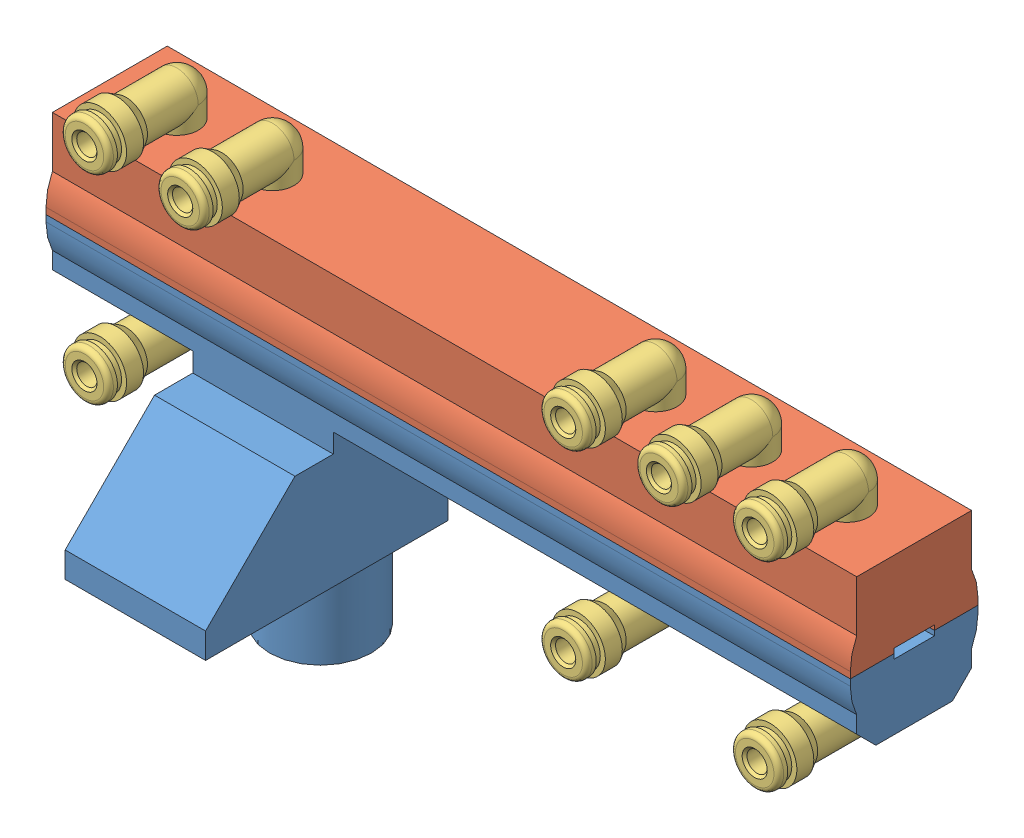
SolidWorks assembly GasTent.SLDASM, configuration Default (file format 7000). Lengths in mm.
Overall size (126 64.98 39).
10 component instances, 3 part files, 12 mates.
Components (placement in the parent):
- TentBottom-1: TentBottom.SLDPRT [Default] at (-30 28 0) size (126 44 39)
- TentTop-1: TentTop.SLDPRT [Default] at (90 30 0) x (-1 0 0) z (0 0 1) size (126 13.36 20)
- 5779K682_PUSH-TO-CONNECT TUBE FITTING FOR AIR-1: 5779K682_PUSH-TO-CONNECT TUBE FITTING FOR AIR.SLDPRT [5779K682] at (82.5 14.571 0) x (-1 0 0) z (0 0 -1) size (8.38 11.62 17.83)
- 5779K682_PUSH-TO-CONNECT TUBE FITTING FOR AIR-2: 5779K682_PUSH-TO-CONNECT TUBE FITTING FOR AIR.SLDPRT [5779K682] at (52.5 14.571 0) x (-1 0 0) z (0 0 -1) size (8.38 11.62 17.83)
- 5779K682_PUSH-TO-CONNECT TUBE FITTING FOR AIR-3: 5779K682_PUSH-TO-CONNECT TUBE FITTING FOR AIR.SLDPRT [5779K682] at (-22.5 14.571 0) x (-1 0 0) z (0 0 -1) size (8.38 11.62 17.83)
- 5779K682_PUSH-TO-CONNECT TUBE FITTING FOR AIR-4: 5779K682_PUSH-TO-CONNECT TUBE FITTING FOR AIR.SLDPRT [5779K682] at (-22.5 45.7879 0) x (1 0 0) z (0 0 -1) size (8.38 11.62 17.83)
- 5779K682_PUSH-TO-CONNECT TUBE FITTING FOR AIR-5: 5779K682_PUSH-TO-CONNECT TUBE FITTING FOR AIR.SLDPRT [5779K682] at (-7.5 45.7879 0) x (1 0 0) z (0 0 -1) size (8.38 11.62 17.83)
- 5779K682_PUSH-TO-CONNECT TUBE FITTING FOR AIR-6: 5779K682_PUSH-TO-CONNECT TUBE FITTING FOR AIR.SLDPRT [5779K682] at (52.5 45.7879 0) x (1 0 0) z (0 0 -1) size (8.38 11.62 17.83)
- 5779K682_PUSH-TO-CONNECT TUBE FITTING FOR AIR-7: 5779K682_PUSH-TO-CONNECT TUBE FITTING FOR AIR.SLDPRT [5779K682] at (67.5 45.7879 0) x (1 0 0) z (0 0 -1) size (8.38 11.62 17.83)
- 5779K682_PUSH-TO-CONNECT TUBE FITTING FOR AIR-8: 5779K682_PUSH-TO-CONNECT TUBE FITTING FOR AIR.SLDPRT [5779K682] at (82.5 45.7879 0) x (1 0 0) z (0 0 -1) size (8.38 11.62 17.83)
Mates (geometry in assembly coordinates):
- Concentric1: concentric: cylinder of TentBottom-1 through (0 -15 0) axis (0 1 0) radius 7.99; point of assembly
- Coincident2: coincident anti-aligned: plane of TentBottom-1 through (90 0 0) normal (0 -1 0); plane of assembly through (0 0 0) normal (0 1 0)
- Coincident4: coincident anti-aligned: plane of TentBottom-1 through (-30 29 0) normal (0 1 0); plane of TentTop-1 through (90 29 0) normal (0 -1 0)
- Coincident5: coincident aligned: plane of TentBottom-1 through (93 28 0) normal (1 0 0); plane of TentTop-1 through (93 30 0) normal (1 0 0)
- Concentric2: concentric anti-aligned: cylinder of TentBottom-1 through (-22.5 29 0) axis (0 -1 0) radius 1.7; cylinder of TentTop-1 through (-22.5 29 0) axis (0 1 0) radius 1.7
- Concentric3: concentric aligned: cylinder of TentBottom-1 through (82.5 29 0) axis (0 -1 0) radius 1.7; cylinder of 5779K682_PUSH-TO-CONNECT TUBE FITTING FOR AIR-1 through (82.5 38.2381 0) axis (0 -1 0) radius 1.5875
- Coincident6: coincident anti-aligned: plane of TentBottom-1 through (11 18 -10) normal (0 -1 0); plane of 5779K682_PUSH-TO-CONNECT TUBE FITTING FOR AIR-1 through (82.5 18 0) normal (0 1 0)
- Parallel2: parallel aligned: plane of TentBottom-1 through (90 28 9) normal (0 0 1); plane of 5779K682_PUSH-TO-CONNECT TUBE FITTING FOR AIR-1 through (82.5 17.5809 14.478) normal (0 0 1)
- Concentric4: concentric aligned: cylinder of TentTop-1 through (-22.5 29 0) axis (0 1 0) radius 1.7; cylinder of 5779K682_PUSH-TO-CONNECT TUBE FITTING FOR AIR-4 through (-22.5 22.1208 0) axis (0 1 0) radius 1.5875
- Parallel3: parallel aligned: plane of TentTop-1 through (-30 30 9) normal (0 0 1); plane of 5779K682_PUSH-TO-CONNECT TUBE FITTING FOR AIR-4 through (-22.5 42.778 14.478) normal (0 0 1)
- Coincident8: coincident anti-aligned: plane of TentTop-1 through (-30 42.3589 0) normal (0 1 0); plane of 5779K682_PUSH-TO-CONNECT TUBE FITTING FOR AIR-4 through (-22.5 42.3589 0) normal (0 -1 0)
- Parallel4: parallel anti-aligned: plane of TentBottom-1 through (-33 28 0) normal (-1 0 0); plane of assembly through (0 0 0) normal (1 0 0)
